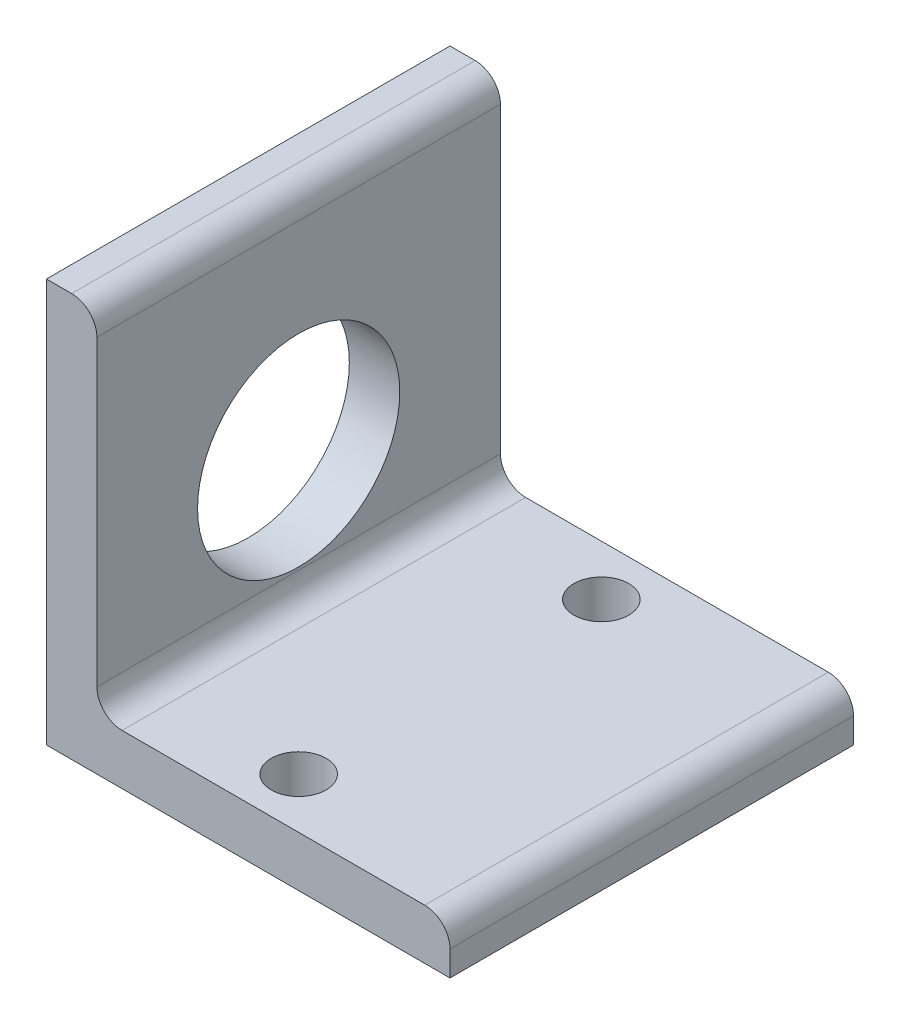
from build123d import *

# Parameters (mm, degrees)
BOSS_EXTRUDE1_DEPTH          = 25.4
F_4_CLEARANCE_HOLE1_D        = 3.4544
F_3_8_0_502_DIAMETER_HOLE1_D = 12.7254
FILLET2_R                    = 1.5875


with BuildPart() as part:
    # Sketch1 → Boss-Extrude1 (new body)
    with BuildSketch(Plane.XY):
        Polygon((0, 25.4), (3.175, 25.4), (3.175, 3.175), (25.4, 3.175), (25.4, 0), (0, 0), align=None)
    extrude(amount=BOSS_EXTRUDE1_DEPTH)

    # 4 Clearance Hole1 (through all)
    with Locations(Plane(origin=(0, 3.175, 0), x_dir=(1, 0, 0), z_dir=(0, 1, 0))):
        with Locations((12.7, -22.225), (12.7, -3.175)):
            Hole(F_4_CLEARANCE_HOLE1_D / 2)

    # 3_8 _0.502_ Diameter Hole1 (through all)
    with Locations(Plane(origin=(0, 0, 0), x_dir=(0, 0, -1), z_dir=(-1, 0, 0))):
        with Locations((-12.7, -11.303)):
            Hole(F_3_8_0_502_DIAMETER_HOLE1_D / 2)

    # Fillet2
    fillet2_edges = [part.edges().sort_by_distance(p)[0] for p in [
        (3.175, 25.4, 12.7),
        (3.175, 3.175, 12.7),
        (25.4, 3.175, 12.7),
    ]]
    fillet(fillet2_edges, radius=FILLET2_R)


solid = part.part
